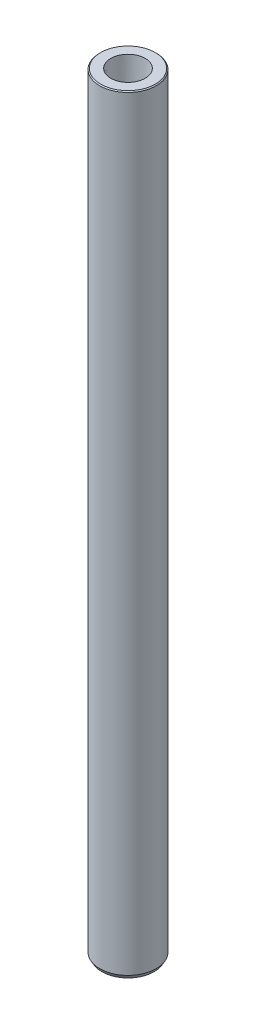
from build123d import *

# Parameters (mm, degrees)
SKETCH1_R          = 7.5
EXTRUDE1_DEPTH     = 204
CHAMFER1_SIZE      = 1
CHAMFER1_SIZE2     = 0.577350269
SKETCH2_R          = 4.5
CUT_EXTRUDE1_DEPTH = 17
CHAMFER2_SIZE      = 0.25
SKETCH5_R          = 4
CUT_EXTRUDE2_DEPTH = 200
CHAMFER3_SIZE      = 0.25


with BuildPart() as part:
    # Sketch1 → Extrude1 (new body)
    with BuildSketch(Plane(origin=(0, 0, 0), x_dir=(1, 0, 0), z_dir=(0, 1, 0))):
        with Locations(Location((0, 0, 0), (0, 0, 270))):
            Circle(SKETCH1_R)
    extrude(amount=EXTRUDE1_DEPTH)

    # Chamfer1
    chamfer1_edges = [part.edges().sort_by_distance(p)[0] for p in [
        (0, 0, -7.5),
    ]]
    chamfer1_side = [part.faces().sort_by_distance(p)[0] for p in [
        (0, 102, -7.5),
    ]]
    chamfer(chamfer1_edges, length=CHAMFER1_SIZE, length2=CHAMFER1_SIZE2, reference=chamfer1_side[0])

    # Sketch2 → Cut-Extrude1 (cut)
    with BuildSketch(Plane.XZ):
        with Locations(Location((0, 0, 0), (0, 0, 270))):
            Circle(SKETCH2_R)
    extrude(amount=-CUT_EXTRUDE1_DEPTH, mode=Mode.SUBTRACT)

    # Chamfer2
    chamfer2_edges = [part.edges().sort_by_distance(p)[0] for p in [
        (0, 204, -7.5),
    ]]
    chamfer(chamfer2_edges, length=CHAMFER2_SIZE)

    # Sketch5 → Cut-Extrude2 (cut)
    with BuildSketch(Plane(origin=(0, 204, 0), x_dir=(-1, 0, 0), z_dir=(0, 1, 0))):
        with Locations(Location((0, 0, 0), (0, 0, 90))):
            Circle(SKETCH5_R)
    extrude(amount=-CUT_EXTRUDE2_DEPTH, mode=Mode.SUBTRACT)

    # Chamfer3
    chamfer3_edges = [part.edges().sort_by_distance(p)[0] for p in [
        (0, 0, 4.5),
    ]]
    chamfer(chamfer3_edges, length=CHAMFER3_SIZE)

    # Sketch7 → 1_8 Rc Tapped Hole1 (revolve, cut)
    with BuildSketch(Plane(origin=(0, 204, 0), x_dir=(0, 0, 1), z_dir=(1, 0, 0))):
        Polygon((0, 0), (0, 14.308399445), (3.95, 11.935), (3.95, 7.4), (4.342497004, 7.4), (4.5735, 0), align=None)
    revolve(axis=Axis((0, 210.35, 0), (0, -1, 0)), mode=Mode.SUBTRACT)


solid = part.part
